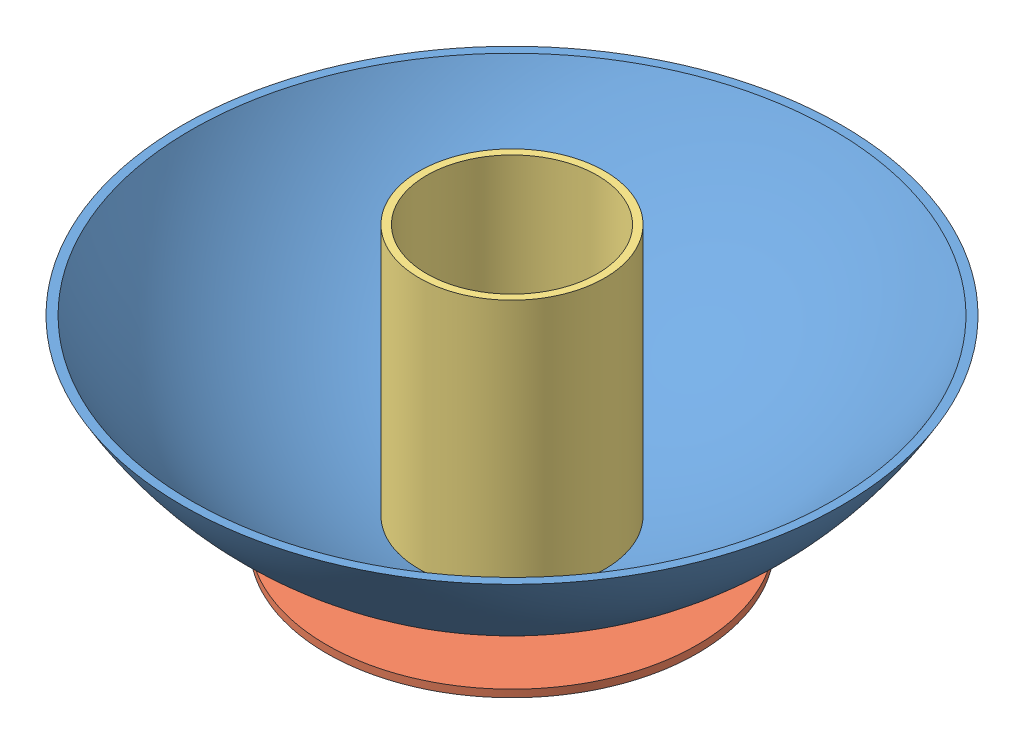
SolidWorks assembly Assem1.SLDASM, configuration Default (file format 4100). Lengths in mm.
Overall size (88.9 37.61 88.9).
3 component instances, 3 part files, 3 mates.
Components (placement in the parent):
- Bowl-1: Bowl.SLDPRT [Default] at origin size (88.9 26 88.9)
- CircularBase-1: CircularBase.SLDPRT [Default] at (0 -52 0) x (0.946551 0 -0.322553) z (0.322553 0 0.946551) size (50 1 50)
- CandleHolder-1: CandleHolder.SLDPRT [Default] at (0 -49.3938 0) x (0.988001 0 -0.154448) z (0.154448 0 0.988001) size (25 35 25)
Mates (geometry in assembly coordinates):
- Concentric1: concentric anti-aligned: cylinder of Bowl-1 through (0 -51 0) axis (0 1 0) radius 0.0005; cylinder of CandleHolder-1 through (0 -14.3938 0) axis (0 -1 0) radius 12.5
- Concentric2: concentric aligned: cylinder of CircularBase-1 through (0 -51 0) axis (0 -1 0) radius 25; cylinder of CandleHolder-1 through (0 -14.3938 0) axis (0 -1 0) radius 12.5
- Tangent1: tangent anti-aligned: sphere of Bowl-1; plane of CircularBase-1 through (0 -51 0) normal (0 1 0)
